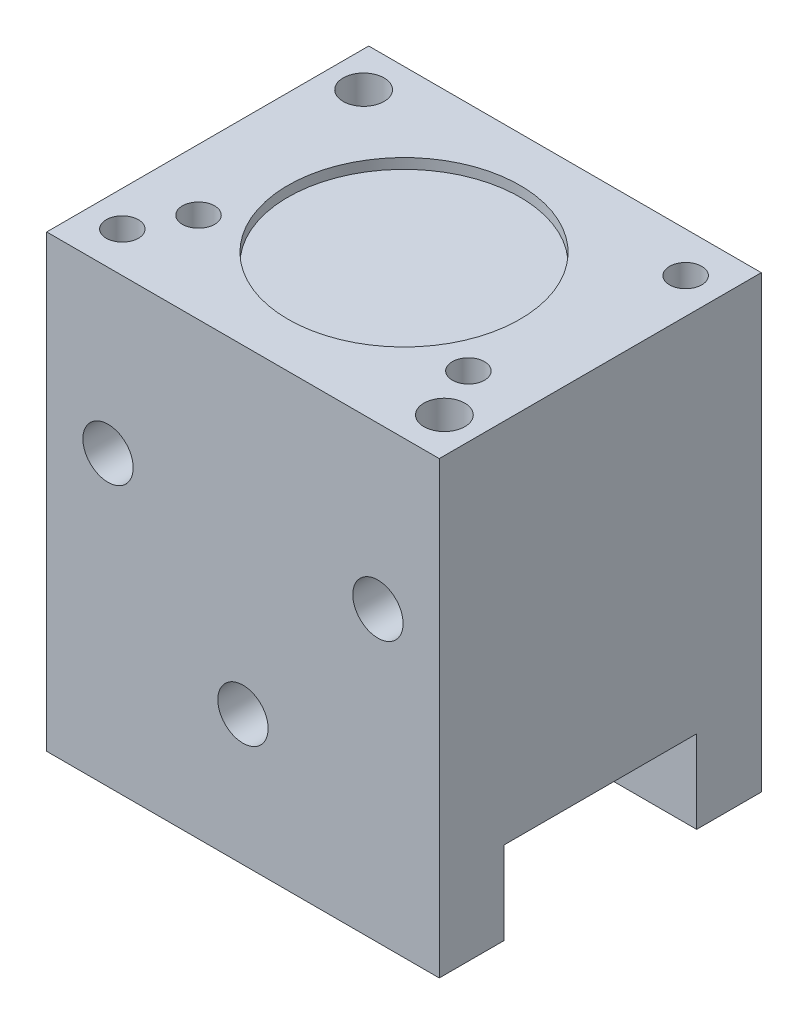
from build123d import *

# Parameters (mm, degrees)
SKETCH1_W                        = 19.5072
SKETCH1_H                        = 16.002
EXTRUDE1_DEPTH                   = 11.176
M2X0_4_MOUNT_HOLES_D             = 1.6
M2X0_4_MOUNT_HOLES_DEPTH         = 6.8326
M2X0_4_MOUNT_HOLES_TIP           = 0.480688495
M2X0_4_OPTIONAL_AIR_PORTS_D      = 1.6
M2X0_4_OPTIONAL_AIR_PORTS_DEPTH  = 6.8326
M2X0_4_OPTIONAL_AIR_PORTS_TIP    = 0.480688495
SKETCH6_R                        = 1.016
F_2MM_DOWEL_HOLES_SLIP_FIT_DEPTH = 1.5875
SKETCH7_R                        = 5.7658
CUT_EXTRUDE2_DEPTH               = 0.508
M3X0_5_AIR_PORTS_D               = 2.5
M3X0_5_AIR_PORTS_DEPTH           = 8.499983
M3X0_5_AIR_PORTS_TIP             = 0.751075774
M3X0_5_EXHAUST_D                 = 2.5
M3X0_5_EXHAUST_DEPTH             = 8.5000084
M3X0_5_EXHAUST_TIP               = 0.751075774
SKETCH12_W                       = 19.5072
SKETCH12_H                       = 9.5758
CUT_EXTRUDE3_DEPTH               = 4.1148
SKETCH13_R                       = 4.4704
CUT_EXTRUDE4_DEPTH               = 4.1148
F_2_56_TAPPED_HOLE1_D            = 1.778
F_2_56_TAPPED_HOLE1_DEPTH        = 6.6421
F_2_56_TAPPED_HOLE1_TIP          = 0.53416509


with BuildPart() as part:
    # Sketch1 → Extrude1 (new, symmetric)
    with BuildSketch(Plane(origin=(0, 0, 0), x_dir=(1, 0, 0), z_dir=(0, 1, 0))):
        Rectangle(SKETCH1_W, SKETCH1_H)
    extrude(amount=EXTRUDE1_DEPTH, both=True)

    # M2x0.4 _Mount Holes
    with Locations(Plane(origin=(0, 11.176, 0), x_dir=(-1, 0, 0), z_dir=(0, 1, 0))):
        with Locations((8.001, 5.9944), (-8.001, -5.9944)):
            Hole(M2X0_4_MOUNT_HOLES_D / 2, depth=M2X0_4_MOUNT_HOLES_DEPTH)
            with Locations((0, 0, -(M2X0_4_MOUNT_HOLES_DEPTH + M2X0_4_MOUNT_HOLES_TIP / 2))):  # 118° drill point
                Cone(0, M2X0_4_MOUNT_HOLES_D / 2, M2X0_4_MOUNT_HOLES_TIP, mode=Mode.SUBTRACT)

    # M2x0.4 _Optional Air Ports
    with Locations(Plane(origin=(0, 11.176, 0), x_dir=(-1, 0, 0), z_dir=(0, 1, 0))):
        with Locations((6.7056, 3.5052), (-6.7056, 3.5052)):
            Hole(M2X0_4_OPTIONAL_AIR_PORTS_D / 2, depth=M2X0_4_OPTIONAL_AIR_PORTS_DEPTH)
            with Locations((0, 0, -(M2X0_4_OPTIONAL_AIR_PORTS_DEPTH + M2X0_4_OPTIONAL_AIR_PORTS_TIP / 2))):  # 118° drill point
                Cone(0, M2X0_4_OPTIONAL_AIR_PORTS_D / 2, M2X0_4_OPTIONAL_AIR_PORTS_TIP, mode=Mode.SUBTRACT)

    # Sketch6 → 2mm Dowel Holes - Slip Fit (cut)
    with BuildSketch(Plane(origin=(0, 11.176, 0), x_dir=(-1, 0, 0), z_dir=(0, 1, 0))):
        with Locations(Location((-8.001, 5.9944, 0), (0, 0, 90))):
            Circle(SKETCH6_R)
        with Locations(Location((8.001, -5.9944, 0), (0, 0, 90))):
            Circle(SKETCH6_R)
    extrude(amount=-F_2MM_DOWEL_HOLES_SLIP_FIT_DEPTH, mode=Mode.SUBTRACT)

    # Sketch7 → Cut-Extrude2 (cut)
    with BuildSketch(Plane(origin=(0, 11.176, 0), x_dir=(-1, 0, 0), z_dir=(0, 1, 0))):
        with Locations(Location((0, 0, 0), (0, 0, 90))):
            Circle(SKETCH7_R)
    extrude(amount=-CUT_EXTRUDE2_DEPTH, mode=Mode.SUBTRACT)

    # M3x0.5 _Air Ports
    with Locations(Plane.XY.offset(8.001)):
        with Locations((-6.7056, 3.175), (6.7056, 3.175)):
            Hole(M3X0_5_AIR_PORTS_D / 2, depth=M3X0_5_AIR_PORTS_DEPTH)
            with Locations((0, 0, -(M3X0_5_AIR_PORTS_DEPTH + M3X0_5_AIR_PORTS_TIP / 2))):  # 118° drill point
                Cone(0, M3X0_5_AIR_PORTS_D / 2, M3X0_5_AIR_PORTS_TIP, mode=Mode.SUBTRACT)

    # M3x0.5 _Exhaust
    with Locations(Plane.XY.offset(8.001)):
        with Locations((0, -4.699)):
            Hole(M3X0_5_EXHAUST_D / 2, depth=M3X0_5_EXHAUST_DEPTH)
            with Locations((0, 0, -(M3X0_5_EXHAUST_DEPTH + M3X0_5_EXHAUST_TIP / 2))):  # 118° drill point
                Cone(0, M3X0_5_EXHAUST_D / 2, M3X0_5_EXHAUST_TIP, mode=Mode.SUBTRACT)

    # Sketch12 → Cut-Extrude3 (cut)
    with BuildSketch(Plane.XZ.offset(11.176)):
        Rectangle(SKETCH12_W, SKETCH12_H)
    extrude(amount=-CUT_EXTRUDE3_DEPTH, mode=Mode.SUBTRACT)

    # Sketch13 → Cut-Extrude4 (cut)
    with BuildSketch(Plane.XZ.offset(7.0612)):
        with Locations(Location((0, 0, 0), (0, 0, 270))):
            Circle(SKETCH13_R)
    extrude(amount=-CUT_EXTRUDE4_DEPTH, mode=Mode.SUBTRACT)

    # 2-56 Tapped Hole1
    with Locations(Plane.XZ.offset(11.176)):
        with Locations((-5.842, 6.1722), (5.842, 6.1722), (5.842, -6.1722), (-5.842, -6.1722)):
            Hole(F_2_56_TAPPED_HOLE1_D / 2, depth=F_2_56_TAPPED_HOLE1_DEPTH)
            with Locations((0, 0, -(F_2_56_TAPPED_HOLE1_DEPTH + F_2_56_TAPPED_HOLE1_TIP / 2))):  # 118° drill point
                Cone(0, F_2_56_TAPPED_HOLE1_D / 2, F_2_56_TAPPED_HOLE1_TIP, mode=Mode.SUBTRACT)


solid = part.part
